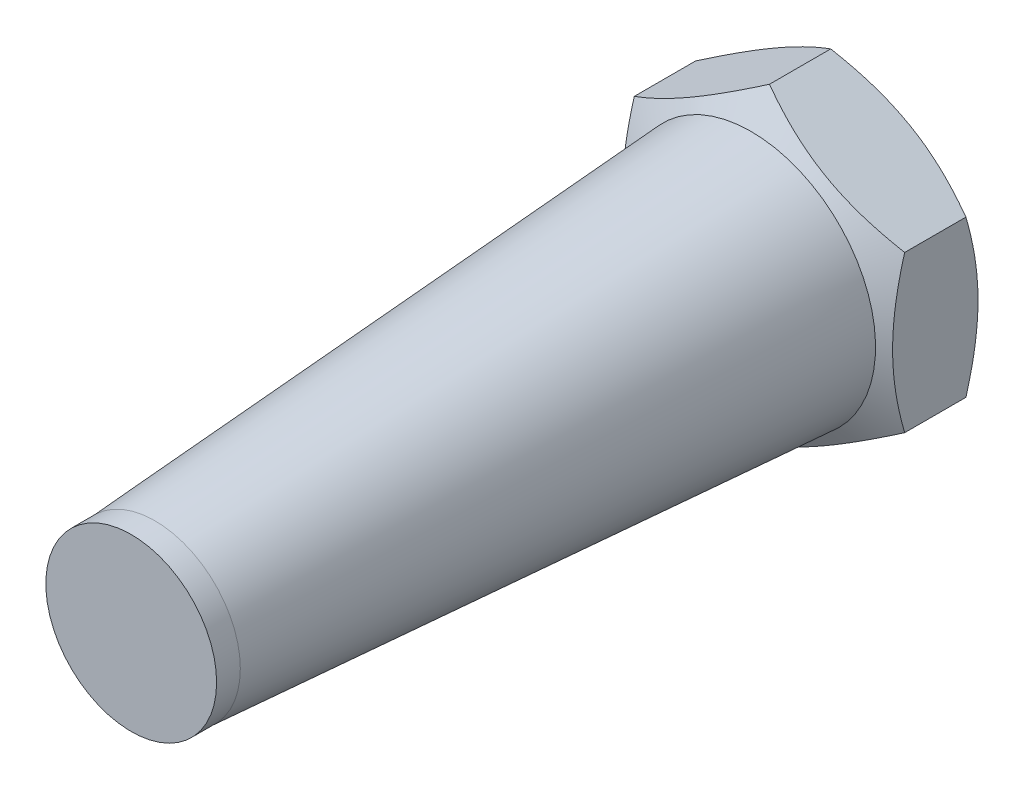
ISO-10303-21;
HEADER;
FILE_DESCRIPTION(('STEP AP214'),'2;1');
FILE_NAME('part.step','',(''),(''),'','','');
FILE_SCHEMA(('AUTOMOTIVE_DESIGN { 1 0 10303 214 1 1 1 1 }'));
ENDSEC;
DATA;
#1=APPLICATION_CONTEXT('core data for automotive mechanical design processes');
#2=APPLICATION_PROTOCOL_DEFINITION('international standard','automotive_design',2000,#1);
#3=PRODUCT_CONTEXT('',#1,'mechanical');
#4=PRODUCT('Part','Part','',(#3));
#5=PRODUCT_RELATED_PRODUCT_CATEGORY('part','',(#4));
#6=PRODUCT_DEFINITION_FORMATION('','',#4);
#7=PRODUCT_DEFINITION_CONTEXT('part definition',#1,'design');
#8=PRODUCT_DEFINITION('design','',#6,#7);
#9=PRODUCT_DEFINITION_SHAPE('','',#8);
#10=(LENGTH_UNIT() NAMED_UNIT(*) SI_UNIT(.MILLI.,.METRE.));
#11=(NAMED_UNIT(*) PLANE_ANGLE_UNIT() SI_UNIT($,.RADIAN.));
#12=(NAMED_UNIT(*) SI_UNIT($,.STERADIAN.) SOLID_ANGLE_UNIT());
#13=UNCERTAINTY_MEASURE_WITH_UNIT(LENGTH_MEASURE(1.E-05),#10,'distance_accuracy_value','');
#14=(GEOMETRIC_REPRESENTATION_CONTEXT(3) GLOBAL_UNCERTAINTY_ASSIGNED_CONTEXT((#13)) GLOBAL_UNIT_ASSIGNED_CONTEXT((#10,
#11,#12)) REPRESENTATION_CONTEXT('',''));
#15=CARTESIAN_POINT('',(0.,0.,0.));
#16=DIRECTION('',(0.,0.,1.));
#17=DIRECTION('',(1.,0.,0.));
#18=AXIS2_PLACEMENT_3D('',#15,#16,#17);
#19=CARTESIAN_POINT('',(0.,0.,3.));
#20=DIRECTION('',(0.,0.,-1.));
#21=DIRECTION('',(-0.500000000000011,0.866025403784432,0.));
#22=AXIS2_PLACEMENT_3D('',#19,#20,#21);
#23=CONICAL_SURFACE('',#22,14.696152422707,1.04719755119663);
#24=CARTESIAN_POINT('',(0.,0.,6.4387862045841));
#25=DIRECTION('',(0.,0.,-1.));
#26=DIRECTION('',(-0.500000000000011,0.866025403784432,0.));
#27=AXIS2_PLACEMENT_3D('',#24,#25,#26);
#28=CIRCLE('',#27,8.74);
#29=CARTESIAN_POINT('',(-4.3700000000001,7.56906202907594,6.4387862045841));
#30=VERTEX_POINT('',#29);
#31=EDGE_CURVE('E280',#30,#30,#28,.T.);
#32=ORIENTED_EDGE('',*,*,#31,.T.);
#33=EDGE_LOOP('',(#32));
#34=FACE_BOUND('',#33,.T.);
#35=CARTESIAN_POINT('',(-17.554595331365,0.83450477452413,1.33823181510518));
#36=CARTESIAN_POINT('',(-17.3747338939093,0.938347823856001,1.43910889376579));
#37=CARTESIAN_POINT('',(-17.1946626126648,1.04231202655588,1.53948688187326));
#38=CARTESIAN_POINT('',(-16.8340565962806,1.25050800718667,1.73913173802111));
#39=CARTESIAN_POINT('',(-16.653521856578,1.35473978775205,1.83839859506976));
#40=CARTESIAN_POINT('',(-16.1111093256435,1.66790180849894,2.13438889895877));
#41=CARTESIAN_POINT('',(-15.7484757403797,1.87726840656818,2.32927254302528));
#42=CARTESIAN_POINT('',(-15.0188452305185,2.29852077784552,2.71400300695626));
#43=CARTESIAN_POINT('',(-14.651835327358,2.5104140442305,2.90381708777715));
#44=CARTESIAN_POINT('',(-13.9149128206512,2.9358764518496,3.27574988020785));
#45=CARTESIAN_POINT('',(-13.5450003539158,3.14944551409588,3.45786895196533));
#46=CARTESIAN_POINT('',(-12.7895973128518,3.58557766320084,3.81814124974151));
#47=CARTESIAN_POINT('',(-12.4039911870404,3.80820746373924,3.99597319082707));
#48=CARTESIAN_POINT('',(-11.6282855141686,4.25606134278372,4.33830520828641));
#49=CARTESIAN_POINT('',(-11.238185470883,4.48128570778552,4.50280379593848));
#50=CARTESIAN_POINT('',(-10.4535819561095,4.93427675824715,4.81418869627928));
#51=CARTESIAN_POINT('',(-10.0590890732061,5.1620373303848,4.96111020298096));
#52=CARTESIAN_POINT('',(-9.26445874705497,5.62081736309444,5.23266326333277));
#53=CARTESIAN_POINT('',(-8.86432310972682,5.85183578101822,5.35730178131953));
#54=CARTESIAN_POINT('',(-8.06032905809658,6.31602196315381,5.57767285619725));
#55=CARTESIAN_POINT('',(-7.65650395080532,6.54917049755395,5.67356307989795));
#56=CARTESIAN_POINT('',(-7.04705287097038,6.90103724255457,5.79170894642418));
#57=CARTESIAN_POINT('',(-6.84326907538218,7.01869187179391,5.82681089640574));
#58=CARTESIAN_POINT('',(-6.43467315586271,7.25459483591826,5.88776442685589));
#59=CARTESIAN_POINT('',(-6.22986113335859,7.37284311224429,5.91361690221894));
#60=CARTESIAN_POINT('',(-5.82217958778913,7.60821816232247,5.9552293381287));
#61=CARTESIAN_POINT('',(-5.61931991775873,7.72533924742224,5.97111749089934));
#62=CARTESIAN_POINT('',(-5.2132003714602,7.95981247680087,5.99297114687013));
#63=CARTESIAN_POINT('',(-5.00994050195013,8.07716461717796,5.99893681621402));
#64=CARTESIAN_POINT('',(-4.60338385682,8.31189020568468,6.00080302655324));
#65=CARTESIAN_POINT('',(-4.40008708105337,8.42926365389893,5.9967035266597));
#66=CARTESIAN_POINT('',(-3.99382512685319,8.66381910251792,5.97854027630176));
#67=CARTESIAN_POINT('',(-3.79085996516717,8.78100109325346,5.96447603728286));
#68=CARTESIAN_POINT('',(-3.3044770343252,9.06181440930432,5.91913176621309));
#69=CARTESIAN_POINT('',(-3.02137657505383,9.22526253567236,5.88321395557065));
#70=CARTESIAN_POINT('',(-2.45726005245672,9.55095536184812,5.79393895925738));
#71=CARTESIAN_POINT('',(-2.17624427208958,9.71319989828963,5.74057944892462));
#72=CARTESIAN_POINT('',(-1.3366568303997,10.1979359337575,5.55716611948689));
#73=CARTESIAN_POINT('',(-0.781851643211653,10.5182528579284,5.40380988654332));
#74=CARTESIAN_POINT('',(0.0478465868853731,10.997279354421,5.13760699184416));
#75=CARTESIAN_POINT('',(0.327036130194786,11.1584695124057,5.04158640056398));
#76=CARTESIAN_POINT('',(0.882703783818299,11.4792843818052,4.8395066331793));
#77=CARTESIAN_POINT('',(1.15918187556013,11.6389090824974,4.7334473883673));
#78=CARTESIAN_POINT('',(1.70951316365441,11.9566429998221,4.51299759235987));
#79=CARTESIAN_POINT('',(1.98336717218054,12.1147526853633,4.39860971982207));
#80=CARTESIAN_POINT('',(2.52880163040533,12.4296594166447,4.16285521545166));
#81=CARTESIAN_POINT('',(2.80038211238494,12.5864564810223,4.04148868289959));
#82=CARTESIAN_POINT('',(3.46345047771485,12.9692791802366,3.73693329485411));
#83=CARTESIAN_POINT('',(3.85382887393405,13.1946642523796,3.5505288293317));
#84=CARTESIAN_POINT('',(4.63109013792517,13.6434162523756,3.16821435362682));
#85=CARTESIAN_POINT('',(5.01797275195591,13.866783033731,2.9723036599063));
#86=CARTESIAN_POINT('',(5.78893210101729,14.3118966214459,2.57297026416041));
#87=CARTESIAN_POINT('',(6.17300807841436,14.5336429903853,2.36954561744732));
#88=CARTESIAN_POINT('',(6.93874708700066,14.9757426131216,1.95677322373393));
#89=CARTESIAN_POINT('',(7.32041017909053,15.1960959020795,1.74742562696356));
#90=CARTESIAN_POINT('',(8.08220788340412,15.635920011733,1.32370484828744));
#91=CARTESIAN_POINT('',(8.46234006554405,15.8553894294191,1.1093258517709));
#92=CARTESIAN_POINT('',(9.22094119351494,16.2933679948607,0.676679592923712));
#93=CARTESIAN_POINT('',(9.5994101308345,16.511877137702,0.458412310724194));
#94=CARTESIAN_POINT('',(10.354894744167,16.9480563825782,0.0187149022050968));
#95=CARTESIAN_POINT('',(10.7319106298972,17.1657266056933,-0.202714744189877));
#96=CARTESIAN_POINT('',(11.4847633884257,17.6003863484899,-0.648231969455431));
#97=CARTESIAN_POINT('',(11.8606002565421,17.8173758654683,-0.872319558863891));
#98=CARTESIAN_POINT('',(12.9195383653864,18.4287540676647,-1.50766534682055));
#99=CARTESIAN_POINT('',(13.6014831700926,18.8224750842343,-1.92149328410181));
#100=CARTESIAN_POINT('',(14.9628991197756,19.6084889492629,-2.7546043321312));
#101=CARTESIAN_POINT('',(15.6423701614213,20.0007817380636,-3.17388766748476));
#102=CARTESIAN_POINT('',(16.997542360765,20.783190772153,-4.01545975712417));
#103=CARTESIAN_POINT('',(17.6732487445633,21.1733100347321,-4.43773729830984));
#104=CARTESIAN_POINT('',(18.6856528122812,21.7578217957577,-5.07354826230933));
#105=CARTESIAN_POINT('',(19.0229182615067,21.9525420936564,-5.28587802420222));
#106=CARTESIAN_POINT('',(19.6971091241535,22.3417863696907,-5.7112548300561));
#107=CARTESIAN_POINT('',(20.0340345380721,22.5363103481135,-5.92430187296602));
#108=CARTESIAN_POINT('',(20.3708096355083,22.7307475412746,-6.13766535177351));
#109=B_SPLINE_CURVE_WITH_KNOTS('',3,(#35,#36,#37,#38,#39,#40,#41,#42,#43,#44,#45,#46,#47,#48,
#49,#50,#51,#52,#53,#54,#55,#56,#57,#58,#59,#60,#61,#62,#63,#64,#65,#66,#67,#68,#69,#70,#71,#72,
#73,#74,#75,#76,#77,#78,#79,#80,#81,#82,#83,#84,#85,#86,#87,#88,#89,#90,#91,#92,#93,#94,#95,#96,
#97,#98,#99,#100,#101,#102,#103,#104,#105,#106,#107,#108),.UNSPECIFIED.,.F.,.F.,(4,2,2,2,2,2,2,
2,2,2,2,2,2,2,2,2,2,2,2,2,2,2,2,2,2,2,2,2,2,2,2,2,2,2,2,2,4),(0.,0.692665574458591,
1.38533799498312,2.77088518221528,4.16388664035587,5.55682282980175,6.99503223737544,
8.4334020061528,9.86884178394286,11.3038321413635,12.7308020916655,13.4443879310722,
14.1579047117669,14.8620428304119,15.5661691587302,16.2702983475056,16.9744620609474,
17.9604967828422,18.9466629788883,20.9200570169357,21.9291006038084,22.9381510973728,
23.946878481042,24.9555915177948,26.4188141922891,27.8821422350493,29.3458516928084,
30.8095240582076,32.2749804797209,33.7404443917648,35.205688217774,36.6709378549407,
39.3395877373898,42.0083478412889,44.6698810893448,46.0005687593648,47.3312544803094),.UNSPECIFIED.);
#110=CARTESIAN_POINT('',(-1.81278603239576E-13,10.9696551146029,5.15149422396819));
#111=VERTEX_POINT('',#110);
#112=CARTESIAN_POINT('',(-9.5,5.48482755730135,5.15149422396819));
#113=VERTEX_POINT('',#112);
#114=EDGE_CURVE('E102',#111,#113,#109,.F.);
#115=ORIENTED_EDGE('',*,*,#114,.T.);
#116=CARTESIAN_POINT('',(-9.5,5.48505849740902,5.15142755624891));
#117=CARTESIAN_POINT('',(-9.5,5.24392149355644,5.22102656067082));
#118=CARTESIAN_POINT('',(-9.5,5.00188540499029,5.28746669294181));
#119=CARTESIAN_POINT('',(-9.5,4.51587227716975,5.41315271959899));
#120=CARTESIAN_POINT('',(-9.5,4.27189462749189,5.4723962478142));
#121=CARTESIAN_POINT('',(-9.5,3.53603045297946,5.63818542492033));
#122=CARTESIAN_POINT('',(-9.5,3.04123900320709,5.73248555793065));
#123=CARTESIAN_POINT('',(-9.5,2.30080624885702,5.84306129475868));
#124=CARTESIAN_POINT('',(-9.5,2.05737704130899,5.87456017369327));
#125=CARTESIAN_POINT('',(-9.5,1.56939156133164,5.92738179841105));
#126=CARTESIAN_POINT('',(-9.5,1.32483526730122,5.94870434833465));
#127=CARTESIAN_POINT('',(-9.5,0.83531474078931,5.98062697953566));
#128=CARTESIAN_POINT('',(-9.5,0.590351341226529,5.99123980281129));
#129=CARTESIAN_POINT('',(-9.5,0.100198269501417,6.00151746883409));
#130=CARTESIAN_POINT('',(-9.5,-0.14499139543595,6.00118264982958));
#131=CARTESIAN_POINT('',(-9.5,-0.603379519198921,5.99032663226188));
#132=CARTESIAN_POINT('',(-9.5,-0.816610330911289,5.98112973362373));
#133=CARTESIAN_POINT('',(-9.5,-1.24257325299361,5.95463460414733));
#134=CARTESIAN_POINT('',(-9.5,-1.45530532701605,5.9373358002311));
#135=CARTESIAN_POINT('',(-9.5,-2.09267726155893,5.87369551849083));
#136=CARTESIAN_POINT('',(-9.5,-2.51618892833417,5.81561809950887));
#137=CARTESIAN_POINT('',(-9.5,-3.36770470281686,5.67042398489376));
#138=CARTESIAN_POINT('',(-9.5,-3.79560013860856,5.58269183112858));
#139=CARTESIAN_POINT('',(-9.5,-4.64501006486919,5.38357626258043));
#140=CARTESIAN_POINT('',(-9.5,-5.06653543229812,5.27223961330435));
#141=CARTESIAN_POINT('',(-9.5,-5.4850584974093,5.15142755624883));
#142=B_SPLINE_CURVE_WITH_KNOTS('',3,(#116,#117,#118,#119,#120,#121,#122,#123,#124,#125,#126,
#127,#128,#129,#130,#131,#132,#133,#134,#135,#136,#137,#138,#139,#140,#141),.UNSPECIFIED.,.F.,
.F.,(4,2,2,2,2,2,2,2,2,2,2,2,4),(0.,0.752880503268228,1.50600787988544,3.01546870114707,
3.75167336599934,4.48789219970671,5.22323407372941,5.9585532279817,6.59868084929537,
7.23885375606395,8.52010929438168,9.82978009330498,11.1368800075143),.UNSPECIFIED.);
#143=CARTESIAN_POINT('',(-9.5,-5.48482755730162,5.15149422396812));
#144=VERTEX_POINT('',#143);
#145=EDGE_CURVE('E93',#113,#144,#142,.T.);
#146=ORIENTED_EDGE('',*,*,#145,.T.);
#147=CARTESIAN_POINT('',(-9.5002,-5.48471208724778,5.15142755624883));
#148=CARTESIAN_POINT('',(-9.2913692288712,-5.60528058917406,5.22102656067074));
#149=CARTESIAN_POINT('',(-9.08175982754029,-5.72629863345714,5.28746669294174));
#150=CARTESIAN_POINT('',(-8.66086011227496,-5.9693051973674,5.41315271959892));
#151=CARTESIAN_POINT('',(-8.4495692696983,-6.09129402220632,5.47239624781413));
#152=CARTESIAN_POINT('',(-7.81229220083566,-6.45922610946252,5.63818542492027));
#153=CARTESIAN_POINT('',(-7.38379023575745,-6.7066218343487,5.7324855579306));
#154=CARTESIAN_POINT('',(-6.74255666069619,-7.07683821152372,5.84306129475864));
#155=CARTESIAN_POINT('',(-6.53174078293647,-7.19855281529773,5.87456017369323));
#156=CARTESIAN_POINT('',(-6.10913296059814,-7.4425455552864,5.92738179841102));
#157=CARTESIAN_POINT('',(-5.89734099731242,-7.5648237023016,5.94870434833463));
#158=CARTESIAN_POINT('',(-5.47340378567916,-7.80958396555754,5.98062697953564));
#159=CARTESIAN_POINT('',(-5.26125925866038,-7.93206566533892,5.99123980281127));
#160=CARTESIAN_POINT('',(-4.83677424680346,-8.17714220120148,6.00151746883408));
#161=CARTESIAN_POINT('',(-4.62443376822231,-8.29973703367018,6.00118264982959));
#162=CARTESIAN_POINT('',(-4.22745800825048,-8.52893109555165,5.99032663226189));
#163=CARTESIAN_POINT('',(-4.04279470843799,-8.63554650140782,5.98112973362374));
#164=CARTESIAN_POINT('',(-3.67389999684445,-8.84852796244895,5.95463460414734));
#165=CARTESIAN_POINT('',(-3.48966861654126,-8.95489399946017,5.93733580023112));
#166=CARTESIAN_POINT('',(-2.93768832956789,-9.2735799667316,5.87369551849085));
#167=CARTESIAN_POINT('',(-2.57091646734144,-9.4853358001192,5.81561809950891));
#168=CARTESIAN_POINT('',(-1.83348217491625,-9.91109368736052,5.67042398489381));
#169=CARTESIAN_POINT('',(-1.46291385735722,-10.1250414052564,5.58269183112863));
#170=CARTESIAN_POINT('',(-0.72730328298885,-10.5497463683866,5.38357626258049));
#171=CARTESIAN_POINT('',(-0.362251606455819,-10.7605090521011,5.27223961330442));
#172=CARTESIAN_POINT('',(0.000200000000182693,-10.9697705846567,5.15142755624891));
#173=B_SPLINE_CURVE_WITH_KNOTS('',3,(#147,#148,#149,#150,#151,#152,#153,#154,#155,#156,#157,
#158,#159,#160,#161,#162,#163,#164,#165,#166,#167,#168,#169,#170,#171,#172),.UNSPECIFIED.,.F.,
.F.,(4,2,2,2,2,2,2,2,2,2,2,2,4),(0.,0.752880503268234,1.50600787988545,3.01546870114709,
3.75167336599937,4.48789219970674,5.22323407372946,5.95855322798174,6.59868084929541,
7.23885375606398,8.5201092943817,9.82978009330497,11.1368800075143),.UNSPECIFIED.);
#174=CARTESIAN_POINT('',(1.81278603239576E-13,-10.9696551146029,5.15149422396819));
#175=VERTEX_POINT('',#174);
#176=EDGE_CURVE('E82',#144,#175,#173,.T.);
#177=ORIENTED_EDGE('',*,*,#176,.T.);
#178=CARTESIAN_POINT('',(-8.0545953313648,-15.6199778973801,1.33823181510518));
#179=CARTESIAN_POINT('',(-7.87473389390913,-15.5161348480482,1.43910889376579));
#180=CARTESIAN_POINT('',(-7.69466261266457,-15.4121706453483,1.53948688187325));
#181=CARTESIAN_POINT('',(-7.33405659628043,-15.2039746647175,1.7391317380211));
#182=CARTESIAN_POINT('',(-7.15352185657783,-15.0997428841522,1.83839859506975));
#183=CARTESIAN_POINT('',(-6.61110932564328,-14.7865808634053,2.13438889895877));
#184=CARTESIAN_POINT('',(-6.24847574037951,-14.577214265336,2.32927254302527));
#185=CARTESIAN_POINT('',(-5.51884523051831,-14.1559618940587,2.71400300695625));
#186=CARTESIAN_POINT('',(-5.15183532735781,-13.9440686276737,2.90381708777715));
#187=CARTESIAN_POINT('',(-4.41491282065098,-13.5186062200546,3.27574988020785));
#188=CARTESIAN_POINT('',(-4.04500035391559,-13.3050371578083,3.45786895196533));
#189=CARTESIAN_POINT('',(-3.28959731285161,-12.8689050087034,3.81814124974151));
#190=CARTESIAN_POINT('',(-2.90399118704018,-12.646275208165,3.99597319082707));
#191=CARTESIAN_POINT('',(-2.12828551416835,-12.1984213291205,4.33830520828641));
#192=CARTESIAN_POINT('',(-1.73818547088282,-11.9731969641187,4.50280379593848));
#193=CARTESIAN_POINT('',(-0.953581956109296,-11.5202059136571,4.81418869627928));
#194=CARTESIAN_POINT('',(-0.559089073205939,-11.2924453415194,4.96111020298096));
#195=CARTESIAN_POINT('',(0.235541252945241,-10.8336653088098,5.23266326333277));
#196=CARTESIAN_POINT('',(0.635676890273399,-10.602646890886,5.35730178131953));
#197=CARTESIAN_POINT('',(1.43967094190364,-10.1384607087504,5.57767285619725));
#198=CARTESIAN_POINT('',(1.84349604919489,-9.90531217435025,5.67356307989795));
#199=CARTESIAN_POINT('',(2.45294712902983,-9.55344542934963,5.79170894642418));
#200=CARTESIAN_POINT('',(2.65673092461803,-9.4357908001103,5.82681089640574));
#201=CARTESIAN_POINT('',(3.06532684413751,-9.19988783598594,5.8877644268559));
#202=CARTESIAN_POINT('',(3.27013886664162,-9.08163955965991,5.91361690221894));
#203=CARTESIAN_POINT('',(3.67782041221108,-8.84626450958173,5.9552293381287));
#204=CARTESIAN_POINT('',(3.88068008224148,-8.72914342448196,5.97111749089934));
#205=CARTESIAN_POINT('',(4.28679962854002,-8.49467019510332,5.99297114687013));
#206=CARTESIAN_POINT('',(4.49005949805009,-8.37731805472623,5.99893681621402));
#207=CARTESIAN_POINT('',(4.89661614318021,-8.14259246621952,6.00080302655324));
#208=CARTESIAN_POINT('',(5.09991291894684,-8.02521901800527,5.9967035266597));
#209=CARTESIAN_POINT('',(5.50617487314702,-7.79066356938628,5.97854027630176));
#210=CARTESIAN_POINT('',(5.70914003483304,-7.67348157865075,5.96447603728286));
#211=CARTESIAN_POINT('',(6.19552296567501,-7.39266826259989,5.91913176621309));
#212=CARTESIAN_POINT('',(6.47862342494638,-7.22922013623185,5.88321395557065));
#213=CARTESIAN_POINT('',(7.04273994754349,-6.90352731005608,5.79393895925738));
#214=CARTESIAN_POINT('',(7.32375572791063,-6.74128277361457,5.74057944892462));
#215=CARTESIAN_POINT('',(8.16334316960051,-6.25654673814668,5.55716611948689));
#216=CARTESIAN_POINT('',(8.71814835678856,-5.93622981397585,5.40380988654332));
#217=CARTESIAN_POINT('',(9.54784658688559,-5.45720331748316,5.13760699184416));
#218=CARTESIAN_POINT('',(9.827036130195,-5.29601315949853,5.04158640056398));
#219=CARTESIAN_POINT('',(10.3827037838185,-4.97519829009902,4.8395066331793));
#220=CARTESIAN_POINT('',(10.6591818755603,-4.81557358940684,4.7334473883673));
#221=CARTESIAN_POINT('',(11.2095131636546,-4.49783967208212,4.51299759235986));
#222=CARTESIAN_POINT('',(11.4833671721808,-4.3397299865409,4.39860971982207));
#223=CARTESIAN_POINT('',(12.0288016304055,-4.02482325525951,4.16285521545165));
#224=CARTESIAN_POINT('',(12.3003821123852,-3.86802619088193,4.04148868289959));
#225=CARTESIAN_POINT('',(12.9634504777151,-3.48520349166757,3.73693329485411));
#226=CARTESIAN_POINT('',(13.3538288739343,-3.25981841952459,3.5505288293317));
#227=CARTESIAN_POINT('',(14.1310901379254,-2.81106641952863,3.16821435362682));
#228=CARTESIAN_POINT('',(14.5179727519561,-2.58769963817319,2.97230365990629));
#229=CARTESIAN_POINT('',(15.2889321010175,-2.14258605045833,2.57297026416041));
#230=CARTESIAN_POINT('',(15.6730080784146,-1.92083968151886,2.36954561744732));
#231=CARTESIAN_POINT('',(16.4387470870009,-1.47874005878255,1.95677322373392));
#232=CARTESIAN_POINT('',(16.8204101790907,-1.25838676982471,1.74742562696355));
#233=CARTESIAN_POINT('',(17.5822078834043,-0.818562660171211,1.32370484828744));
#234=CARTESIAN_POINT('',(17.9623400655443,-0.599093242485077,1.1093258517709));
#235=CARTESIAN_POINT('',(18.7209411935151,-0.16111467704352,0.676679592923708));
#236=CARTESIAN_POINT('',(19.0994101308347,0.0573944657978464,0.45841231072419));
#237=CARTESIAN_POINT('',(19.8548947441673,0.493573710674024,0.0187149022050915));
#238=CARTESIAN_POINT('',(20.2319106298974,0.711243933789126,-0.202714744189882));
#239=CARTESIAN_POINT('',(20.9847633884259,1.14590367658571,-0.648231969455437));
#240=CARTESIAN_POINT('',(21.3606002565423,1.36289319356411,-0.872319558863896));
#241=CARTESIAN_POINT('',(22.4195383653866,1.97427139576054,-1.50766534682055));
#242=CARTESIAN_POINT('',(23.1014831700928,2.3679924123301,-1.92149328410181));
#243=CARTESIAN_POINT('',(24.4628991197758,3.15400627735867,-2.7546043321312));
#244=CARTESIAN_POINT('',(25.1423701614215,3.54629906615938,-3.17388766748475));
#245=CARTESIAN_POINT('',(26.4975423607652,4.3287081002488,-4.01545975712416));
#246=CARTESIAN_POINT('',(27.1732487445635,4.7188273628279,-4.43773729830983));
#247=CARTESIAN_POINT('',(28.1856528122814,5.3033391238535,-5.07354826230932));
#248=CARTESIAN_POINT('',(28.5229182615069,5.49805942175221,-5.28587802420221));
#249=CARTESIAN_POINT('',(29.1971091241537,5.88730369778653,-5.71125483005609));
#250=CARTESIAN_POINT('',(29.5340345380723,6.08182767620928,-5.92430187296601));
#251=CARTESIAN_POINT('',(29.8708096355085,6.27626486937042,-6.13766535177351));
#252=B_SPLINE_CURVE_WITH_KNOTS('',3,(#178,#179,#180,#181,#182,#183,#184,#185,#186,#187,#188,
#189,#190,#191,#192,#193,#194,#195,#196,#197,#198,#199,#200,#201,#202,#203,#204,#205,#206,#207,
#208,#209,#210,#211,#212,#213,#214,#215,#216,#217,#218,#219,#220,#221,#222,#223,#224,#225,#226,
#227,#228,#229,#230,#231,#232,#233,#234,#235,#236,#237,#238,#239,#240,#241,#242,#243,#244,#245,
#246,#247,#248,#249,#250,#251),.UNSPECIFIED.,.F.,.F.,(4,2,2,2,2,2,2,2,2,2,2,2,2,2,2,2,2,2,2,2,2,
2,2,2,2,2,2,2,2,2,2,2,2,2,2,2,4),(0.,0.692665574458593,1.38533799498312,2.77088518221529,
4.16388664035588,5.55682282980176,6.99503223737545,8.43340200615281,9.86884178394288,
11.3038321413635,12.7308020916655,13.4443879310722,14.1579047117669,14.8620428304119,
15.5661691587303,16.2702983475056,16.9744620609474,17.9604967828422,18.9466629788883,
20.9200570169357,21.9291006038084,22.9381510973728,23.946878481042,24.9555915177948,
26.4188141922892,27.8821422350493,29.3458516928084,30.8095240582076,32.2749804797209,
33.7404443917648,35.205688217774,36.6709378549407,39.3395877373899,42.0083478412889,
44.6698810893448,46.0005687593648,47.3312544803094),.UNSPECIFIED.);
#253=CARTESIAN_POINT('',(9.5,-5.48482755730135,5.15149422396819));
#254=VERTEX_POINT('',#253);
#255=EDGE_CURVE('E229',#175,#254,#252,.T.);
#256=ORIENTED_EDGE('',*,*,#255,.T.);
#257=CARTESIAN_POINT('',(9.5,-5.48505849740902,5.15142755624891));
#258=CARTESIAN_POINT('',(9.5,-5.24392149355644,5.22102656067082));
#259=CARTESIAN_POINT('',(9.5,-5.00188540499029,5.28746669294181));
#260=CARTESIAN_POINT('',(9.5,-4.51587227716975,5.41315271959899));
#261=CARTESIAN_POINT('',(9.5,-4.27189462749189,5.4723962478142));
#262=CARTESIAN_POINT('',(9.5,-3.53603045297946,5.63818542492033));
#263=CARTESIAN_POINT('',(9.5,-3.04123900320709,5.73248555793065));
#264=CARTESIAN_POINT('',(9.5,-2.30080624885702,5.84306129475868));
#265=CARTESIAN_POINT('',(9.5,-2.05737704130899,5.87456017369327));
#266=CARTESIAN_POINT('',(9.5,-1.56939156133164,5.92738179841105));
#267=CARTESIAN_POINT('',(9.5,-1.32483526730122,5.94870434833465));
#268=CARTESIAN_POINT('',(9.5,-0.83531474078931,5.98062697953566));
#269=CARTESIAN_POINT('',(9.5,-0.590351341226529,5.99123980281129));
#270=CARTESIAN_POINT('',(9.5,-0.100198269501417,6.00151746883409));
#271=CARTESIAN_POINT('',(9.5,0.14499139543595,6.00118264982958));
#272=CARTESIAN_POINT('',(9.5,0.603379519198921,5.99032663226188));
#273=CARTESIAN_POINT('',(9.5,0.816610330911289,5.98112973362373));
#274=CARTESIAN_POINT('',(9.5,1.24257325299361,5.95463460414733));
#275=CARTESIAN_POINT('',(9.5,1.45530532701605,5.9373358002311));
#276=CARTESIAN_POINT('',(9.5,2.09267726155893,5.87369551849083));
#277=CARTESIAN_POINT('',(9.5,2.51618892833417,5.81561809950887));
#278=CARTESIAN_POINT('',(9.5,3.36770470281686,5.67042398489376));
#279=CARTESIAN_POINT('',(9.5,3.79560013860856,5.58269183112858));
#280=CARTESIAN_POINT('',(9.5,4.64501006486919,5.38357626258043));
#281=CARTESIAN_POINT('',(9.5,5.06653543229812,5.27223961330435));
#282=CARTESIAN_POINT('',(9.5,5.4850584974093,5.15142755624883));
#283=B_SPLINE_CURVE_WITH_KNOTS('',3,(#257,#258,#259,#260,#261,#262,#263,#264,#265,#266,#267,
#268,#269,#270,#271,#272,#273,#274,#275,#276,#277,#278,#279,#280,#281,#282),.UNSPECIFIED.,.F.,
.F.,(4,2,2,2,2,2,2,2,2,2,2,2,4),(0.,0.752880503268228,1.50600787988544,3.01546870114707,
3.75167336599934,4.48789219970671,5.22323407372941,5.9585532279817,6.59868084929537,
7.23885375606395,8.52010929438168,9.82978009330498,11.1368800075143),.UNSPECIFIED.);
#284=CARTESIAN_POINT('',(9.5,5.48482755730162,5.15149422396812));
#285=VERTEX_POINT('',#284);
#286=EDGE_CURVE('E215',#254,#285,#283,.T.);
#287=ORIENTED_EDGE('',*,*,#286,.T.);
#288=CARTESIAN_POINT('',(9.5002,5.48471208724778,5.15142755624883));
#289=CARTESIAN_POINT('',(9.2913692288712,5.60528058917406,5.22102656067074));
#290=CARTESIAN_POINT('',(9.08175982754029,5.72629863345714,5.28746669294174));
#291=CARTESIAN_POINT('',(8.66086011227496,5.9693051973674,5.41315271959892));
#292=CARTESIAN_POINT('',(8.4495692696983,6.09129402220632,5.47239624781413));
#293=CARTESIAN_POINT('',(7.81229220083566,6.45922610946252,5.63818542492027));
#294=CARTESIAN_POINT('',(7.38379023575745,6.7066218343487,5.7324855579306));
#295=CARTESIAN_POINT('',(6.74255666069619,7.07683821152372,5.84306129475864));
#296=CARTESIAN_POINT('',(6.53174078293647,7.19855281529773,5.87456017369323));
#297=CARTESIAN_POINT('',(6.10913296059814,7.4425455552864,5.92738179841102));
#298=CARTESIAN_POINT('',(5.89734099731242,7.5648237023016,5.94870434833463));
#299=CARTESIAN_POINT('',(5.47340378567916,7.80958396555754,5.98062697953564));
#300=CARTESIAN_POINT('',(5.26125925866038,7.93206566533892,5.99123980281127));
#301=CARTESIAN_POINT('',(4.83677424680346,8.17714220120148,6.00151746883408));
#302=CARTESIAN_POINT('',(4.62443376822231,8.29973703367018,6.00118264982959));
#303=CARTESIAN_POINT('',(4.22745800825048,8.52893109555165,5.99032663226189));
#304=CARTESIAN_POINT('',(4.04279470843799,8.63554650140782,5.98112973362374));
#305=CARTESIAN_POINT('',(3.67389999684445,8.84852796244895,5.95463460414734));
#306=CARTESIAN_POINT('',(3.48966861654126,8.95489399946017,5.93733580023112));
#307=CARTESIAN_POINT('',(2.93768832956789,9.2735799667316,5.87369551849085));
#308=CARTESIAN_POINT('',(2.57091646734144,9.4853358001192,5.81561809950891));
#309=CARTESIAN_POINT('',(1.83348217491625,9.91109368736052,5.67042398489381));
#310=CARTESIAN_POINT('',(1.46291385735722,10.1250414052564,5.58269183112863));
#311=CARTESIAN_POINT('',(0.72730328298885,10.5497463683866,5.38357626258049));
#312=CARTESIAN_POINT('',(0.362251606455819,10.7605090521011,5.27223961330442));
#313=CARTESIAN_POINT('',(-0.000200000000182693,10.9697705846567,5.15142755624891));
#314=B_SPLINE_CURVE_WITH_KNOTS('',3,(#288,#289,#290,#291,#292,#293,#294,#295,#296,#297,#298,
#299,#300,#301,#302,#303,#304,#305,#306,#307,#308,#309,#310,#311,#312,#313),.UNSPECIFIED.,.F.,
.F.,(4,2,2,2,2,2,2,2,2,2,2,2,4),(0.,0.752880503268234,1.50600787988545,3.01546870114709,
3.75167336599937,4.48789219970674,5.22323407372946,5.95855322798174,6.59868084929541,
7.23885375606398,8.5201092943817,9.82978009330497,11.1368800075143),.UNSPECIFIED.);
#315=EDGE_CURVE('E188',#285,#111,#314,.T.);
#316=ORIENTED_EDGE('',*,*,#315,.T.);
#317=EDGE_LOOP('',(#115,#146,#177,#256,#287,#316));
#318=FACE_BOUND('',#317,.T.);
#319=ADVANCED_FACE('F14',(#34,#318),#23,.T.);
#320=CARTESIAN_POINT('',(0.,0.,50.));
#321=DIRECTION('',(0.,0.,1.));
#322=DIRECTION('',(0.500000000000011,-0.866025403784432,0.));
#323=AXIS2_PLACEMENT_3D('',#320,#321,#322);
#324=PLANE('',#323);
#325=CARTESIAN_POINT('',(0.,0.,50.));
#326=DIRECTION('',(0.,0.,-1.));
#327=DIRECTION('',(-0.500000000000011,0.866025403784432,0.));
#328=AXIS2_PLACEMENT_3D('',#325,#326,#327);
#329=CIRCLE('',#328,6.);
#330=CARTESIAN_POINT('',(-3.00000000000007,5.19615242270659,50.));
#331=VERTEX_POINT('',#330);
#332=EDGE_CURVE('E9',#331,#331,#329,.T.);
#333=ORIENTED_EDGE('',*,*,#332,.F.);
#334=EDGE_LOOP('',(#333));
#335=FACE_BOUND('',#334,.T.);
#336=ADVANCED_FACE('F16',(#335),#324,.T.);
#337=CARTESIAN_POINT('',(0.,0.,26.653));
#338=DIRECTION('',(0.,0.,-1.));
#339=DIRECTION('',(-0.500000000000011,0.866025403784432,0.));
#340=AXIS2_PLACEMENT_3D('',#337,#338,#339);
#341=CYLINDRICAL_SURFACE('',#340,6.);
#342=ORIENTED_EDGE('',*,*,#332,.T.);
#343=EDGE_LOOP('',(#342));
#344=FACE_BOUND('',#343,.T.);
#345=CARTESIAN_POINT('',(0.,0.,48.333333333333));
#346=DIRECTION('',(0.,0.,-1.));
#347=DIRECTION('',(-0.500000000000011,0.866025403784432,0.));
#348=AXIS2_PLACEMENT_3D('',#345,#346,#347);
#349=CIRCLE('',#348,6.);
#350=CARTESIAN_POINT('',(-3.00000000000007,5.19615242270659,48.333333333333));
#351=VERTEX_POINT('',#350);
#352=EDGE_CURVE('E22',#351,#351,#349,.T.);
#353=ORIENTED_EDGE('',*,*,#352,.F.);
#354=EDGE_LOOP('',(#353));
#355=FACE_BOUND('',#354,.T.);
#356=ADVANCED_FACE('F301',(#344,#355),#341,.T.);
#357=CARTESIAN_POINT('',(0.,0.,6.4387862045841));
#358=DIRECTION('',(0.,0.,-1.));
#359=DIRECTION('',(-0.500000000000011,0.866025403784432,0.));
#360=AXIS2_PLACEMENT_3D('',#357,#358,#359);
#361=CONICAL_SURFACE('',#360,8.74,0.0653092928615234);
#362=ORIENTED_EDGE('',*,*,#352,.T.);
#363=EDGE_LOOP('',(#362));
#364=FACE_BOUND('',#363,.T.);
#365=ORIENTED_EDGE('',*,*,#31,.F.);
#366=EDGE_LOOP('',(#365));
#367=FACE_BOUND('',#366,.T.);
#368=ADVANCED_FACE('F131',(#364,#367),#361,.T.);
#369=CARTESIAN_POINT('',(-9.5,5.48482755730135,-50.));
#370=DIRECTION('',(-1.,0.,0.));
#371=DIRECTION('',(0.,-1.,0.));
#372=AXIS2_PLACEMENT_3D('',#369,#370,#371);
#373=PLANE('',#372);
#374=DIRECTION('',(0.,0.,1.));
#375=VECTOR('',#374,1.);
#376=CARTESIAN_POINT('',(-9.5,5.48482755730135,-50.));
#377=LINE('',#376,#375);
#378=CARTESIAN_POINT('',(-9.5,5.48482755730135,0.848505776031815));
#379=VERTEX_POINT('',#378);
#380=EDGE_CURVE('E258',#379,#113,#377,.T.);
#381=ORIENTED_EDGE('',*,*,#380,.F.);
#382=CARTESIAN_POINT('',(-9.5,-5.4850584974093,0.848572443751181));
#383=CARTESIAN_POINT('',(-9.5,-5.24392149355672,0.778973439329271));
#384=CARTESIAN_POINT('',(-9.5,-5.00188540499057,0.712533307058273));
#385=CARTESIAN_POINT('',(-9.5,-4.51587227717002,0.586847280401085));
#386=CARTESIAN_POINT('',(-9.5,-4.27189462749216,0.527603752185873));
#387=CARTESIAN_POINT('',(-9.5,-3.53603045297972,0.361814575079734));
#388=CARTESIAN_POINT('',(-9.5,-3.04123900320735,0.267514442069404));
#389=CARTESIAN_POINT('',(-9.5,-2.30080624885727,0.156938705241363));
#390=CARTESIAN_POINT('',(-9.5,-2.05737704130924,0.125439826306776));
#391=CARTESIAN_POINT('',(-9.5,-1.56939156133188,0.0726182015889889));
#392=CARTESIAN_POINT('',(-9.5,-1.32483526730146,0.0512956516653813));
#393=CARTESIAN_POINT('',(-9.5,-0.835314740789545,0.0193730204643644));
#394=CARTESIAN_POINT('',(-9.5,-0.590351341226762,0.00876019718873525));
#395=CARTESIAN_POINT('',(-9.5,-0.100198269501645,-0.00151746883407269));
#396=CARTESIAN_POINT('',(-9.5,0.144991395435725,-0.0011826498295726));
#397=CARTESIAN_POINT('',(-9.5,0.603379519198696,0.0096733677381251));
#398=CARTESIAN_POINT('',(-9.5,0.816610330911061,0.018870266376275));
#399=CARTESIAN_POINT('',(-9.5,1.24257325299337,0.0453653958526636));
#400=CARTESIAN_POINT('',(-9.5,1.45530532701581,0.0626641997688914));
#401=CARTESIAN_POINT('',(-9.5,2.09267726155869,0.126304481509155));
#402=CARTESIAN_POINT('',(-9.5,2.51618892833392,0.184381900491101));
#403=CARTESIAN_POINT('',(-9.5,3.3677047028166,0.3295760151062));
#404=CARTESIAN_POINT('',(-9.5,3.7956001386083,0.417308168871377));
#405=CARTESIAN_POINT('',(-9.5,4.64501006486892,0.616423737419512));
#406=CARTESIAN_POINT('',(-9.5,5.06653543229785,0.727760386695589));
#407=CARTESIAN_POINT('',(-9.5,5.48505849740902,0.848572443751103));
#408=B_SPLINE_CURVE_WITH_KNOTS('',3,(#382,#383,#384,#385,#386,#387,#388,#389,#390,#391,#392,
#393,#394,#395,#396,#397,#398,#399,#400,#401,#402,#403,#404,#405,#406,#407),.UNSPECIFIED.,.F.,
.F.,(4,2,2,2,2,2,2,2,2,2,2,2,4),(0.,0.752880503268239,1.50600787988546,3.0154687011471,
3.75167336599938,4.48789219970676,5.22323407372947,5.95855322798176,6.59868084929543,
7.238853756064,8.52010929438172,9.829780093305,11.1368800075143),.UNSPECIFIED.);
#409=CARTESIAN_POINT('',(-9.5,0.,0.));
#410=VERTEX_POINT('',#409);
#411=EDGE_CURVE('E109',#410,#379,#408,.T.);
#412=ORIENTED_EDGE('',*,*,#411,.F.);
#413=CARTESIAN_POINT('',(-9.5,-5.48482755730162,0.848505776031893));
#414=VERTEX_POINT('',#413);
#415=EDGE_CURVE('E96',#414,#410,#408,.T.);
#416=ORIENTED_EDGE('',*,*,#415,.F.);
#417=DIRECTION('',(0.,0.,1.));
#418=VECTOR('',#417,1.);
#419=CARTESIAN_POINT('',(-9.5,-5.48482755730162,-50.));
#420=LINE('',#419,#418);
#421=EDGE_CURVE('E35',#414,#144,#420,.T.);
#422=ORIENTED_EDGE('',*,*,#421,.T.);
#423=ORIENTED_EDGE('',*,*,#145,.F.);
#424=EDGE_LOOP('',(#381,#412,#416,#422,#423));
#425=FACE_BOUND('',#424,.T.);
#426=ADVANCED_FACE('F92',(#425),#373,.T.);
#427=CARTESIAN_POINT('',(-1.81278603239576E-13,10.9696551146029,-50.));
#428=DIRECTION('',(-0.500000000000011,0.866025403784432,0.));
#429=DIRECTION('',(-0.866025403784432,-0.500000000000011,0.));
#430=AXIS2_PLACEMENT_3D('',#427,#428,#429);
#431=PLANE('',#430);
#432=DIRECTION('',(0.,0.,1.));
#433=VECTOR('',#432,1.);
#434=CARTESIAN_POINT('',(-1.81278603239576E-13,10.9696551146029,-50.));
#435=LINE('',#434,#433);
#436=CARTESIAN_POINT('',(-1.81278603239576E-13,10.9696551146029,0.848505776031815));
#437=VERTEX_POINT('',#436);
#438=EDGE_CURVE('E255',#437,#111,#435,.T.);
#439=ORIENTED_EDGE('',*,*,#438,.F.);
#440=CARTESIAN_POINT('',(-17.6079762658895,0.803685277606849,4.69172618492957));
#441=CARTESIAN_POINT('',(-17.4278975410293,0.907653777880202,4.59060472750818));
#442=CARTESIAN_POINT('',(-17.2476101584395,1.01174274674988,4.48997893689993));
#443=CARTESIAN_POINT('',(-16.8865745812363,1.22018673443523,4.28983072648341));
#444=CARTESIAN_POINT('',(-16.7058263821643,1.32454175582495,4.19030831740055));
#445=CARTESIAN_POINT('',(-16.1627785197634,1.63807058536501,3.89353871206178));
#446=CARTESIAN_POINT('',(-15.799727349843,1.84767827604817,3.69811828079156));
#447=CARTESIAN_POINT('',(-15.0692994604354,2.26939101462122,3.3122810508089));
#448=CARTESIAN_POINT('',(-14.7019100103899,2.48150341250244,3.12189630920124));
#449=CARTESIAN_POINT('',(-13.9642441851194,2.90739497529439,2.74876351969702));
#450=CARTESIAN_POINT('',(-13.5939679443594,3.12117406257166,2.56601511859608));
#451=CARTESIAN_POINT('',(-12.8375931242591,3.55786726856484,2.20426740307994));
#452=CARTESIAN_POINT('',(-12.4513771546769,3.78084916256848,2.02559358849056));
#453=CARTESIAN_POINT('',(-11.674464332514,4.22939998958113,1.68149388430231));
#454=CARTESIAN_POINT('',(-11.2837669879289,4.45496920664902,1.5160694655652));
#455=CARTESIAN_POINT('',(-10.4979649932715,4.90865219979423,1.20272862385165));
#456=CARTESIAN_POINT('',(-10.1028707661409,5.13675995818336,1.05477771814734));
#457=CARTESIAN_POINT('',(-9.30702925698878,5.59623926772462,0.781054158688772));
#458=CARTESIAN_POINT('',(-8.90628376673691,5.82760978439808,0.655274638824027));
#459=CARTESIAN_POINT('',(-8.10110070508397,6.29248244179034,0.43254028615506));
#460=CARTESIAN_POINT('',(-7.69669749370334,6.52596474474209,0.335424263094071));
#461=CARTESIAN_POINT('',(-7.08633198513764,6.87835943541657,0.215390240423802));
#462=CARTESIAN_POINT('',(-6.88223572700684,6.99619446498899,0.179650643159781));
#463=CARTESIAN_POINT('',(-6.4729954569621,7.23246944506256,0.11741628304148));
#464=CARTESIAN_POINT('',(-6.26785154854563,7.35090933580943,0.0909206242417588));
#465=CARTESIAN_POINT('',(-5.85951371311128,7.58666329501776,0.048040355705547));
#466=CARTESIAN_POINT('',(-5.65633002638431,7.70397145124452,0.0315262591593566));
#467=CARTESIAN_POINT('',(-5.24953960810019,7.93883200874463,0.00844006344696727));
#468=CARTESIAN_POINT('',(-5.04593288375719,8.05638440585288,0.00186779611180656));
#469=CARTESIAN_POINT('',(-4.6386613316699,8.29152274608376,-0.00117752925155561));
#470=CARTESIAN_POINT('',(-4.43499650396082,8.40910868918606,0.00234940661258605));
#471=CARTESIAN_POINT('',(-4.02797922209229,8.64410022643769,0.0194147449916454));
#472=CARTESIAN_POINT('',(-3.82462678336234,8.76150581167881,0.0329536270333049));
#473=CARTESIAN_POINT('',(-3.33886786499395,9.04195885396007,0.0769634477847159));
#474=CARTESIAN_POINT('',(-3.05676444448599,9.20483133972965,0.111994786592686));
#475=CARTESIAN_POINT('',(-2.49460019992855,9.52939701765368,0.199439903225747));
#476=CARTESIAN_POINT('',(-2.21453964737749,9.69109005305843,0.25185594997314));
#477=CARTESIAN_POINT('',(-1.37777018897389,10.1741991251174,0.432406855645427));
#478=CARTESIAN_POINT('',(-0.824774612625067,10.4934712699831,0.583813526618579));
#479=CARTESIAN_POINT('',(0.00221202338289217,10.9709322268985,0.84712031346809));
#480=CARTESIAN_POINT('',(0.280475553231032,11.131587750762,0.942164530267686));
#481=CARTESIAN_POINT('',(0.834301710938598,11.4513394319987,1.1423154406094));
#482=CARTESIAN_POINT('',(1.10986432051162,11.6104355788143,1.24742220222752));
#483=CARTESIAN_POINT('',(1.65837183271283,11.9271165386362,1.46599605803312));
#484=CARTESIAN_POINT('',(1.93131752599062,12.0847018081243,1.57946053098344));
#485=CARTESIAN_POINT('',(2.47493670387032,12.3985604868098,1.81339584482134));
#486=CARTESIAN_POINT('',(2.74561021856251,12.5548339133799,1.93386659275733));
#487=CARTESIAN_POINT('',(3.39739076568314,12.9311395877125,2.23211274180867));
#488=CARTESIAN_POINT('',(3.7774841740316,13.1505866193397,2.41283667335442));
#489=CARTESIAN_POINT('',(4.53431346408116,13.5875422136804,2.78345507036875));
#490=CARTESIAN_POINT('',(4.91104911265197,13.8050506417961,2.97335016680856));
#491=CARTESIAN_POINT('',(5.66180844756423,14.2385017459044,3.36042547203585));
#492=CARTESIAN_POINT('',(6.03583142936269,14.4544440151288,3.557607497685));
#493=CARTESIAN_POINT('',(6.78153668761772,14.8849771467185,3.95774536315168));
#494=CARTESIAN_POINT('',(7.15321902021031,15.0995680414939,4.16070106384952));
#495=CARTESIAN_POINT('',(7.89508306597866,15.5278834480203,4.5715234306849));
#496=CARTESIAN_POINT('',(8.26526246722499,15.7416066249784,4.77939565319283));
#497=CARTESIAN_POINT('',(9.0039939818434,16.1681134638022,5.19895991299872));
#498=CARTESIAN_POINT('',(9.37254608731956,16.3808971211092,5.41065196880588));
#499=CARTESIAN_POINT('',(10.1082260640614,16.8056421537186,5.83715506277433));
#500=CARTESIAN_POINT('',(10.4753541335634,17.0176036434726,6.05196564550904));
#501=CARTESIAN_POINT('',(11.208449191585,17.440856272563,6.48421388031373));
#502=CARTESIAN_POINT('',(11.5744161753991,17.6521474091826,6.70165154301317));
#503=CARTESIAN_POINT('',(12.6069850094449,18.2483013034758,7.31908016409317));
#504=CARTESIAN_POINT('',(13.2724375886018,18.632500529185,7.72163366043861));
#505=CARTESIAN_POINT('',(14.6008779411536,19.3994759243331,8.53218731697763));
#506=CARTESIAN_POINT('',(15.2638656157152,19.7822520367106,8.94018769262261));
#507=CARTESIAN_POINT('',(16.5861399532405,20.5456674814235,9.75924293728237));
#508=CARTESIAN_POINT('',(17.245431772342,20.9263097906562,10.1702867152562));
#509=CARTESIAN_POINT('',(18.2332133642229,21.4966057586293,10.7892558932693));
#510=CARTESIAN_POINT('',(18.5622716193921,21.6865876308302,10.995973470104));
#511=CARTESIAN_POINT('',(19.2200473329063,22.0663546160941,11.4101289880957));
#512=CARTESIAN_POINT('',(19.5487647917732,22.2561397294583,11.6175669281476));
#513=CARTESIAN_POINT('',(19.8773314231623,22.4458377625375,11.825323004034));
#514=B_SPLINE_CURVE_WITH_KNOTS('',3,(#440,#441,#442,#443,#444,#445,#446,#447,#448,#449,#450,
#451,#452,#453,#454,#455,#456,#457,#458,#459,#460,#461,#462,#463,#464,#465,#466,#467,#468,#469,
#470,#471,#472,#473,#474,#475,#476,#477,#478,#479,#480,#481,#482,#483,#484,#485,#486,#487,#488,
#489,#490,#491,#492,#493,#494,#495,#496,#497,#498,#499,#500,#501,#502,#503,#504,#505,#506,#507,
#508,#509,#510,#511,#512,#513),.UNSPECIFIED.,.F.,.F.,(4,2,2,2,2,2,2,2,2,2,2,2,2,2,2,2,2,2,2,2,2,
2,2,2,2,2,2,2,2,2,2,2,2,2,2,2,4),(0.,0.693663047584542,1.3873328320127,2.77487186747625,
4.16977436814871,5.56461227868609,7.00572345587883,8.44699439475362,9.88537180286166,
11.3233029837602,12.7529867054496,13.4679278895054,14.1827997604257,14.8881868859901,
15.5935620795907,16.2989368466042,17.0043454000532,17.9866623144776,18.9691074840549,
20.9350403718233,21.940173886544,22.9453142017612,23.9501406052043,24.9549536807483,
26.3787498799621,27.8026441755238,29.2268959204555,30.6511133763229,32.0770255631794,
33.5029446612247,34.9286575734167,36.3543762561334,38.956720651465,41.5591682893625,
44.154653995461,45.4523211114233,46.7499862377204),.UNSPECIFIED.);
#515=CARTESIAN_POINT('',(-4.75000000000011,8.22724133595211,0.));
#516=VERTEX_POINT('',#515);
#517=EDGE_CURVE('E180',#516,#437,#514,.T.);
#518=ORIENTED_EDGE('',*,*,#517,.F.);
#519=EDGE_CURVE('E187',#379,#516,#514,.T.);
#520=ORIENTED_EDGE('',*,*,#519,.F.);
#521=ORIENTED_EDGE('',*,*,#380,.T.);
#522=ORIENTED_EDGE('',*,*,#114,.F.);
#523=EDGE_LOOP('',(#439,#518,#520,#521,#522));
#524=FACE_BOUND('',#523,.T.);
#525=ADVANCED_FACE('F130',(#524),#431,.T.);
#526=CARTESIAN_POINT('',(9.5,5.48482755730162,-50.));
#527=DIRECTION('',(0.499999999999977,0.866025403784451,0.));
#528=DIRECTION('',(-0.866025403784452,0.499999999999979,0.));
#529=AXIS2_PLACEMENT_3D('',#526,#527,#528);
#530=PLANE('',#529);
#531=DIRECTION('',(0.,0.,1.));
#532=VECTOR('',#531,1.);
#533=CARTESIAN_POINT('',(9.5,5.48482755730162,-50.));
#534=LINE('',#533,#532);
#535=CARTESIAN_POINT('',(9.5,5.48482755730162,0.848505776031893));
#536=VERTEX_POINT('',#535);
#537=EDGE_CURVE('E250',#536,#285,#534,.T.);
#538=ORIENTED_EDGE('',*,*,#537,.F.);
#539=CARTESIAN_POINT('',(-0.000200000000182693,10.9697705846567,0.848572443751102));
#540=CARTESIAN_POINT('',(0.208630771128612,10.8492020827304,0.778973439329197));
#541=CARTESIAN_POINT('',(0.418240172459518,10.7281840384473,0.712533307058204));
#542=CARTESIAN_POINT('',(0.839139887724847,10.4851774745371,0.586847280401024));
#543=CARTESIAN_POINT('',(1.0504307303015,10.3631886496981,0.527603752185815));
#544=CARTESIAN_POINT('',(1.68770779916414,9.99525656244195,0.361814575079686));
#545=CARTESIAN_POINT('',(2.11620976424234,9.74786083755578,0.267514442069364));
#546=CARTESIAN_POINT('',(2.7574433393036,9.37764446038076,0.156938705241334));
#547=CARTESIAN_POINT('',(2.96825921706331,9.25592985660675,0.125439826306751));
#548=CARTESIAN_POINT('',(3.39086703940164,9.01193711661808,0.0726182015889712));
#549=CARTESIAN_POINT('',(3.60265900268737,8.88965896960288,0.0512956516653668));
#550=CARTESIAN_POINT('',(4.02659621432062,8.64489870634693,0.0193730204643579));
#551=CARTESIAN_POINT('',(4.23874074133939,8.52241700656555,0.00876019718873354));
#552=CARTESIAN_POINT('',(4.66322575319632,8.27734047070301,-0.00151746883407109));
#553=CARTESIAN_POINT('',(4.87556623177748,8.15474563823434,-0.00118264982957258));
#554=CARTESIAN_POINT('',(5.27254199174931,7.92555157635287,0.00967336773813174));
#555=CARTESIAN_POINT('',(5.45720529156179,7.81893617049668,0.0188702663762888));
#556=CARTESIAN_POINT('',(5.82610000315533,7.60595470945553,0.0453653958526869));
#557=CARTESIAN_POINT('',(6.01033138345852,7.49958867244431,0.062664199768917));
#558=CARTESIAN_POINT('',(6.5623116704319,7.18090270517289,0.126304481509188));
#559=CARTESIAN_POINT('',(6.92908353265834,6.96914687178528,0.184381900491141));
#560=CARTESIAN_POINT('',(7.66651782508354,6.54338898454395,0.329576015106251));
#561=CARTESIAN_POINT('',(8.03708614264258,6.32944126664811,0.417308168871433));
#562=CARTESIAN_POINT('',(8.77269671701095,5.90473630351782,0.616423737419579));
#563=CARTESIAN_POINT('',(9.13774839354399,5.69397361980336,0.72776038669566));
#564=CARTESIAN_POINT('',(9.5002,5.48471208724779,0.848572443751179));
#565=B_SPLINE_CURVE_WITH_KNOTS('',3,(#539,#540,#541,#542,#543,#544,#545,#546,#547,#548,#549,
#550,#551,#552,#553,#554,#555,#556,#557,#558,#559,#560,#561,#562,#563,#564),.UNSPECIFIED.,.F.,
.F.,(4,2,2,2,2,2,2,2,2,2,2,2,4),(0.,0.752880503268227,1.50600787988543,3.01546870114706,
3.75167336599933,4.4878921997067,5.22323407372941,5.95855322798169,6.59868084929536,
7.23885375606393,8.52010929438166,9.82978009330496,11.1368800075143),.UNSPECIFIED.);
#566=CARTESIAN_POINT('',(4.7499999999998,8.22724133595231,0.));
#567=VERTEX_POINT('',#566);
#568=EDGE_CURVE('E172',#567,#536,#565,.T.);
#569=ORIENTED_EDGE('',*,*,#568,.F.);
#570=EDGE_CURVE('E223',#437,#567,#565,.T.);
#571=ORIENTED_EDGE('',*,*,#570,.F.);
#572=ORIENTED_EDGE('',*,*,#438,.T.);
#573=ORIENTED_EDGE('',*,*,#315,.F.);
#574=EDGE_LOOP('',(#538,#569,#571,#572,#573));
#575=FACE_BOUND('',#574,.T.);
#576=ADVANCED_FACE('F200',(#575),#530,.T.);
#577=CARTESIAN_POINT('',(9.5,-5.48482755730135,-50.));
#578=DIRECTION('',(1.,0.,0.));
#579=DIRECTION('',(0.,1.,0.));
#580=AXIS2_PLACEMENT_3D('',#577,#578,#579);
#581=PLANE('',#580);
#582=DIRECTION('',(0.,0.,1.));
#583=VECTOR('',#582,1.);
#584=CARTESIAN_POINT('',(9.5,-5.48482755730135,-50.));
#585=LINE('',#584,#583);
#586=CARTESIAN_POINT('',(9.5,-5.48482755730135,0.848505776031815));
#587=VERTEX_POINT('',#586);
#588=EDGE_CURVE('E248',#587,#254,#585,.T.);
#589=ORIENTED_EDGE('',*,*,#588,.F.);
#590=CARTESIAN_POINT('',(9.5,5.4850584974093,0.848572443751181));
#591=CARTESIAN_POINT('',(9.5,5.24392149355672,0.778973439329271));
#592=CARTESIAN_POINT('',(9.5,5.00188540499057,0.712533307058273));
#593=CARTESIAN_POINT('',(9.5,4.51587227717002,0.586847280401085));
#594=CARTESIAN_POINT('',(9.5,4.27189462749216,0.527603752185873));
#595=CARTESIAN_POINT('',(9.5,3.53603045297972,0.361814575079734));
#596=CARTESIAN_POINT('',(9.5,3.04123900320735,0.267514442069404));
#597=CARTESIAN_POINT('',(9.5,2.30080624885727,0.156938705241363));
#598=CARTESIAN_POINT('',(9.5,2.05737704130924,0.125439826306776));
#599=CARTESIAN_POINT('',(9.5,1.56939156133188,0.0726182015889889));
#600=CARTESIAN_POINT('',(9.5,1.32483526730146,0.0512956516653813));
#601=CARTESIAN_POINT('',(9.5,0.835314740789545,0.0193730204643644));
#602=CARTESIAN_POINT('',(9.5,0.590351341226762,0.00876019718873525));
#603=CARTESIAN_POINT('',(9.5,0.100198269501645,-0.00151746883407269));
#604=CARTESIAN_POINT('',(9.5,-0.144991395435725,-0.0011826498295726));
#605=CARTESIAN_POINT('',(9.5,-0.603379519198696,0.0096733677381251));
#606=CARTESIAN_POINT('',(9.5,-0.816610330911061,0.018870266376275));
#607=CARTESIAN_POINT('',(9.5,-1.24257325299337,0.0453653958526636));
#608=CARTESIAN_POINT('',(9.5,-1.45530532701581,0.0626641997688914));
#609=CARTESIAN_POINT('',(9.5,-2.09267726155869,0.126304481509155));
#610=CARTESIAN_POINT('',(9.5,-2.51618892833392,0.184381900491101));
#611=CARTESIAN_POINT('',(9.5,-3.3677047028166,0.3295760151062));
#612=CARTESIAN_POINT('',(9.5,-3.7956001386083,0.417308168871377));
#613=CARTESIAN_POINT('',(9.5,-4.64501006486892,0.616423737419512));
#614=CARTESIAN_POINT('',(9.5,-5.06653543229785,0.727760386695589));
#615=CARTESIAN_POINT('',(9.5,-5.48505849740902,0.848572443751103));
#616=B_SPLINE_CURVE_WITH_KNOTS('',3,(#590,#591,#592,#593,#594,#595,#596,#597,#598,#599,#600,
#601,#602,#603,#604,#605,#606,#607,#608,#609,#610,#611,#612,#613,#614,#615),.UNSPECIFIED.,.F.,
.F.,(4,2,2,2,2,2,2,2,2,2,2,2,4),(0.,0.752880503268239,1.50600787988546,3.0154687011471,
3.75167336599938,4.48789219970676,5.22323407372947,5.95855322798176,6.59868084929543,
7.238853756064,8.52010929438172,9.829780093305,11.1368800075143),.UNSPECIFIED.);
#617=CARTESIAN_POINT('',(9.5,0.,0.));
#618=VERTEX_POINT('',#617);
#619=EDGE_CURVE('E164',#618,#587,#616,.T.);
#620=ORIENTED_EDGE('',*,*,#619,.F.);
#621=EDGE_CURVE('E221',#536,#618,#616,.T.);
#622=ORIENTED_EDGE('',*,*,#621,.F.);
#623=ORIENTED_EDGE('',*,*,#537,.T.);
#624=ORIENTED_EDGE('',*,*,#286,.F.);
#625=EDGE_LOOP('',(#589,#620,#622,#623,#624));
#626=FACE_BOUND('',#625,.T.);
#627=ADVANCED_FACE('F206',(#626),#581,.T.);
#628=CARTESIAN_POINT('',(1.81278603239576E-13,-10.9696551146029,-50.));
#629=DIRECTION('',(0.500000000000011,-0.866025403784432,0.));
#630=DIRECTION('',(0.866025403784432,0.500000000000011,0.));
#631=AXIS2_PLACEMENT_3D('',#628,#629,#630);
#632=PLANE('',#631);
#633=DIRECTION('',(0.,0.,1.));
#634=VECTOR('',#633,1.);
#635=CARTESIAN_POINT('',(1.81278603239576E-13,-10.9696551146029,-50.));
#636=LINE('',#635,#634);
#637=CARTESIAN_POINT('',(1.81278603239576E-13,-10.9696551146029,0.848505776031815));
#638=VERTEX_POINT('',#637);
#639=EDGE_CURVE('E29',#638,#175,#636,.T.);
#640=ORIENTED_EDGE('',*,*,#639,.F.);
#641=CARTESIAN_POINT('',(-8.10797626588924,-15.6507973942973,4.69172618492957));
#642=CARTESIAN_POINT('',(-7.92789754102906,-15.546828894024,4.59060472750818));
#643=CARTESIAN_POINT('',(-7.74761015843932,-15.4427399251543,4.48997893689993));
#644=CARTESIAN_POINT('',(-7.38657458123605,-15.234295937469,4.28983072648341));
#645=CARTESIAN_POINT('',(-7.20582638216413,-15.1299409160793,4.19030831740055));
#646=CARTESIAN_POINT('',(-6.66277851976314,-14.8164120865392,3.89353871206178));
#647=CARTESIAN_POINT('',(-6.29972734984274,-14.606804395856,3.69811828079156));
#648=CARTESIAN_POINT('',(-5.56929946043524,-14.185091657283,3.3122810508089));
#649=CARTESIAN_POINT('',(-5.20191001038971,-13.9729792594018,3.12189630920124));
#650=CARTESIAN_POINT('',(-4.46424418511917,-13.5470876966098,2.74876351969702));
#651=CARTESIAN_POINT('',(-4.09396794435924,-13.3333086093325,2.56601511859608));
#652=CARTESIAN_POINT('',(-3.33759312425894,-12.8966154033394,2.20426740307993));
#653=CARTESIAN_POINT('',(-2.9513771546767,-12.6736335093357,2.02559358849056));
#654=CARTESIAN_POINT('',(-2.17446433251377,-12.2250826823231,1.68149388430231));
#655=CARTESIAN_POINT('',(-1.78376698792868,-11.9995134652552,1.5160694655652));
#656=CARTESIAN_POINT('',(-0.997964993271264,-11.54583047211,1.20272862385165));
#657=CARTESIAN_POINT('',(-0.602870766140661,-11.3177227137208,1.05477771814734));
#658=CARTESIAN_POINT('',(0.192970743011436,-10.8582434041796,0.781054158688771));
#659=CARTESIAN_POINT('',(0.593716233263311,-10.6268728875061,0.655274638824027));
#660=CARTESIAN_POINT('',(1.39889929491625,-10.1620002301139,0.432540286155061));
#661=CARTESIAN_POINT('',(1.80330250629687,-9.92851792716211,0.335424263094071));
#662=CARTESIAN_POINT('',(2.41366801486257,-9.57612323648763,0.215390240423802));
#663=CARTESIAN_POINT('',(2.61776427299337,-9.45828820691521,0.179650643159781));
#664=CARTESIAN_POINT('',(3.02700454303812,-9.22201322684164,0.11741628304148));
#665=CARTESIAN_POINT('',(3.23214845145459,-9.10357333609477,0.0909206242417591));
#666=CARTESIAN_POINT('',(3.64048628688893,-8.86781937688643,0.0480403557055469));
#667=CARTESIAN_POINT('',(3.8436699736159,-8.75051122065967,0.0315262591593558));
#668=CARTESIAN_POINT('',(4.25046039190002,-8.51565066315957,0.0084400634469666));
#669=CARTESIAN_POINT('',(4.45406711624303,-8.39809826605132,0.00186779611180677));
#670=CARTESIAN_POINT('',(4.86133866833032,-8.16295992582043,-0.00117752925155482));
#671=CARTESIAN_POINT('',(5.06500349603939,-8.04537398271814,0.00234940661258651));
#672=CARTESIAN_POINT('',(5.47202077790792,-7.81038244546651,0.0194147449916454));
#673=CARTESIAN_POINT('',(5.67537321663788,-7.6929768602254,0.0329536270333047));
#674=CARTESIAN_POINT('',(6.16113213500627,-7.41252381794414,0.0769634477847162));
#675=CARTESIAN_POINT('',(6.44323555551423,-7.24965133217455,0.111994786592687));
#676=CARTESIAN_POINT('',(7.00539980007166,-6.92508565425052,0.199439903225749));
#677=CARTESIAN_POINT('',(7.28546035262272,-6.76339261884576,0.251855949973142));
#678=CARTESIAN_POINT('',(8.12222981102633,-6.28028354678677,0.432406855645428));
#679=CARTESIAN_POINT('',(8.67522538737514,-5.9610114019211,0.583813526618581));
#680=CARTESIAN_POINT('',(9.5022120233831,-5.48355044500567,0.847120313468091));
#681=CARTESIAN_POINT('',(9.78047555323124,-5.32289492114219,0.942164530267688));
#682=CARTESIAN_POINT('',(10.3343017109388,-5.00314323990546,1.1423154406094));
#683=CARTESIAN_POINT('',(10.6098643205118,-4.84404709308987,1.24742220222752));
#684=CARTESIAN_POINT('',(11.158371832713,-4.52736613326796,1.46599605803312));
#685=CARTESIAN_POINT('',(11.4313175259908,-4.36978086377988,1.57946053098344));
#686=CARTESIAN_POINT('',(11.9749367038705,-4.05592218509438,1.81339584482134));
#687=CARTESIAN_POINT('',(12.2456102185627,-3.89964875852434,1.93386659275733));
#688=CARTESIAN_POINT('',(12.8973907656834,-3.52334308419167,2.23211274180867));
#689=CARTESIAN_POINT('',(13.2774841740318,-3.30389605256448,2.41283667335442));
#690=CARTESIAN_POINT('',(14.0343134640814,-2.86694045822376,2.78345507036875));
#691=CARTESIAN_POINT('',(14.4110491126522,-2.64943203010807,2.97335016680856));
#692=CARTESIAN_POINT('',(15.1618084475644,-2.21598092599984,3.36042547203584));
#693=CARTESIAN_POINT('',(15.5358314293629,-2.00003865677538,3.557607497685));
#694=CARTESIAN_POINT('',(16.2815366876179,-1.56950552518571,3.95774536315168));
#695=CARTESIAN_POINT('',(16.6532190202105,-1.35491463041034,4.16070106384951));
#696=CARTESIAN_POINT('',(17.3950830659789,-0.926599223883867,4.5715234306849));
#697=CARTESIAN_POINT('',(17.7652624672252,-0.712876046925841,4.77939565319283));
#698=CARTESIAN_POINT('',(18.5039939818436,-0.286369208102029,5.19895991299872));
#699=CARTESIAN_POINT('',(18.8725460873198,-0.0735855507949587,5.41065196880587));
#700=CARTESIAN_POINT('',(19.6082260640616,0.35115948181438,5.83715506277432));
#701=CARTESIAN_POINT('',(19.9753541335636,0.563120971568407,6.05196564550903));
#702=CARTESIAN_POINT('',(20.7084491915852,0.986373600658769,6.48421388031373));
#703=CARTESIAN_POINT('',(21.0744161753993,1.19766473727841,6.70165154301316));
#704=CARTESIAN_POINT('',(22.1069850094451,1.79381863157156,7.31908016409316));
#705=CARTESIAN_POINT('',(22.772437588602,2.17801785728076,7.7216336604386));
#706=CARTESIAN_POINT('',(24.1008779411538,2.94499325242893,8.53218731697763));
#707=CARTESIAN_POINT('',(24.7638656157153,3.32776936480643,8.9401876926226));
#708=CARTESIAN_POINT('',(26.0861399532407,4.09118480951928,9.75924293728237));
#709=CARTESIAN_POINT('',(26.7454317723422,4.47182711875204,10.1702867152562));
#710=CARTESIAN_POINT('',(27.7332133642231,5.04212308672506,10.7892558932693));
#711=CARTESIAN_POINT('',(28.0622716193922,5.23210495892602,10.995973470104));
#712=CARTESIAN_POINT('',(28.7200473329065,5.61187194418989,11.4101289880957));
#713=CARTESIAN_POINT('',(29.0487647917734,5.80165705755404,11.6175669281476));
#714=CARTESIAN_POINT('',(29.3773314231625,5.99135509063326,11.825323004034));
#715=B_SPLINE_CURVE_WITH_KNOTS('',3,(#641,#642,#643,#644,#645,#646,#647,#648,#649,#650,#651,
#652,#653,#654,#655,#656,#657,#658,#659,#660,#661,#662,#663,#664,#665,#666,#667,#668,#669,#670,
#671,#672,#673,#674,#675,#676,#677,#678,#679,#680,#681,#682,#683,#684,#685,#686,#687,#688,#689,
#690,#691,#692,#693,#694,#695,#696,#697,#698,#699,#700,#701,#702,#703,#704,#705,#706,#707,#708,
#709,#710,#711,#712,#713,#714),.UNSPECIFIED.,.F.,.F.,(4,2,2,2,2,2,2,2,2,2,2,2,2,2,2,2,2,2,2,2,2,
2,2,2,2,2,2,2,2,2,2,2,2,2,2,2,4),(0.,0.693663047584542,1.3873328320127,2.77487186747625,
4.16977436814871,5.56461227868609,7.00572345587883,8.44699439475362,9.88537180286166,
11.3233029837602,12.7529867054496,13.4679278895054,14.1827997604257,14.8881868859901,
15.5935620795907,16.2989368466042,17.0043454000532,17.9866623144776,18.9691074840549,
20.9350403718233,21.940173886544,22.9453142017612,23.9501406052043,24.9549536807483,
26.3787498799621,27.8026441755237,29.2268959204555,30.6511133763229,32.0770255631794,
33.5029446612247,34.9286575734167,36.3543762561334,38.956720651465,41.5591682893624,
44.154653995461,45.4523211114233,46.7499862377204),.UNSPECIFIED.);
#716=CARTESIAN_POINT('',(4.75000000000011,-8.22724133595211,0.));
#717=VERTEX_POINT('',#716);
#718=EDGE_CURVE('E87',#717,#638,#715,.F.);
#719=ORIENTED_EDGE('',*,*,#718,.F.);
#720=EDGE_CURVE('E232',#587,#717,#715,.F.);
#721=ORIENTED_EDGE('',*,*,#720,.F.);
#722=ORIENTED_EDGE('',*,*,#588,.T.);
#723=ORIENTED_EDGE('',*,*,#255,.F.);
#724=EDGE_LOOP('',(#640,#719,#721,#722,#723));
#725=FACE_BOUND('',#724,.T.);
#726=ADVANCED_FACE('F211',(#725),#632,.T.);
#727=CARTESIAN_POINT('',(-9.5,-5.48482755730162,-50.));
#728=DIRECTION('',(-0.499999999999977,-0.866025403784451,0.));
#729=DIRECTION('',(0.866025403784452,-0.499999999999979,0.));
#730=AXIS2_PLACEMENT_3D('',#727,#728,#729);
#731=PLANE('',#730);
#732=ORIENTED_EDGE('',*,*,#421,.F.);
#733=CARTESIAN_POINT('',(0.000200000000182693,-10.9697705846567,0.848572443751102));
#734=CARTESIAN_POINT('',(-0.208630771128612,-10.8492020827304,0.778973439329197));
#735=CARTESIAN_POINT('',(-0.418240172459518,-10.7281840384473,0.712533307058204));
#736=CARTESIAN_POINT('',(-0.839139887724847,-10.4851774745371,0.586847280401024));
#737=CARTESIAN_POINT('',(-1.0504307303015,-10.3631886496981,0.527603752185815));
#738=CARTESIAN_POINT('',(-1.68770779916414,-9.99525656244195,0.361814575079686));
#739=CARTESIAN_POINT('',(-2.11620976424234,-9.74786083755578,0.267514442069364));
#740=CARTESIAN_POINT('',(-2.7574433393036,-9.37764446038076,0.156938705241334));
#741=CARTESIAN_POINT('',(-2.96825921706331,-9.25592985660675,0.125439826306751));
#742=CARTESIAN_POINT('',(-3.39086703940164,-9.01193711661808,0.0726182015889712));
#743=CARTESIAN_POINT('',(-3.60265900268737,-8.88965896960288,0.0512956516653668));
#744=CARTESIAN_POINT('',(-4.02659621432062,-8.64489870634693,0.0193730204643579));
#745=CARTESIAN_POINT('',(-4.23874074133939,-8.52241700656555,0.00876019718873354));
#746=CARTESIAN_POINT('',(-4.66322575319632,-8.27734047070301,-0.00151746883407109));
#747=CARTESIAN_POINT('',(-4.87556623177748,-8.15474563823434,-0.00118264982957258));
#748=CARTESIAN_POINT('',(-5.27254199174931,-7.92555157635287,0.00967336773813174));
#749=CARTESIAN_POINT('',(-5.45720529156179,-7.81893617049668,0.0188702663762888));
#750=CARTESIAN_POINT('',(-5.82610000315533,-7.60595470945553,0.0453653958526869));
#751=CARTESIAN_POINT('',(-6.01033138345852,-7.49958867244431,0.062664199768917));
#752=CARTESIAN_POINT('',(-6.5623116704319,-7.18090270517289,0.126304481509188));
#753=CARTESIAN_POINT('',(-6.92908353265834,-6.96914687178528,0.184381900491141));
#754=CARTESIAN_POINT('',(-7.66651782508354,-6.54338898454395,0.329576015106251));
#755=CARTESIAN_POINT('',(-8.03708614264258,-6.32944126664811,0.417308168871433));
#756=CARTESIAN_POINT('',(-8.77269671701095,-5.90473630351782,0.616423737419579));
#757=CARTESIAN_POINT('',(-9.13774839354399,-5.69397361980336,0.72776038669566));
#758=CARTESIAN_POINT('',(-9.5002,-5.48471208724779,0.848572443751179));
#759=B_SPLINE_CURVE_WITH_KNOTS('',3,(#733,#734,#735,#736,#737,#738,#739,#740,#741,#742,#743,
#744,#745,#746,#747,#748,#749,#750,#751,#752,#753,#754,#755,#756,#757,#758),.UNSPECIFIED.,.F.,
.F.,(4,2,2,2,2,2,2,2,2,2,2,2,4),(0.,0.752880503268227,1.50600787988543,3.01546870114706,
3.75167336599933,4.4878921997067,5.22323407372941,5.95855322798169,6.59868084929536,
7.23885375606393,8.52010929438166,9.82978009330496,11.1368800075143),.UNSPECIFIED.);
#760=CARTESIAN_POINT('',(-4.74999999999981,-8.2272413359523,0.));
#761=VERTEX_POINT('',#760);
#762=EDGE_CURVE('E149',#761,#414,#759,.T.);
#763=ORIENTED_EDGE('',*,*,#762,.F.);
#764=EDGE_CURVE('E88',#638,#761,#759,.T.);
#765=ORIENTED_EDGE('',*,*,#764,.F.);
#766=ORIENTED_EDGE('',*,*,#639,.T.);
#767=ORIENTED_EDGE('',*,*,#176,.F.);
#768=EDGE_LOOP('',(#732,#763,#765,#766,#767));
#769=FACE_BOUND('',#768,.T.);
#770=ADVANCED_FACE('F83',(#769),#731,.T.);
#771=CARTESIAN_POINT('',(0.,0.,0.));
#772=DIRECTION('',(0.,0.,1.));
#773=DIRECTION('',(0.500000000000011,-0.866025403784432,0.));
#774=AXIS2_PLACEMENT_3D('',#771,#772,#773);
#775=CONICAL_SURFACE('',#774,9.5,1.04719755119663);
#776=CARTESIAN_POINT('',(0.,0.,0.));
#777=DIRECTION('',(0.,0.,-1.));
#778=DIRECTION('',(-0.500000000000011,0.866025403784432,0.));
#779=AXIS2_PLACEMENT_3D('',#776,#777,#778);
#780=CIRCLE('',#779,9.5);
#781=EDGE_CURVE('E103',#410,#516,#780,.T.);
#782=ORIENTED_EDGE('',*,*,#781,.F.);
#783=ORIENTED_EDGE('',*,*,#411,.T.);
#784=ORIENTED_EDGE('',*,*,#519,.T.);
#785=EDGE_LOOP('',(#782,#783,#784));
#786=FACE_BOUND('',#785,.T.);
#787=ADVANCED_FACE('F144',(#786),#775,.T.);
#788=EDGE_CURVE('E243',#717,#761,#780,.T.);
#789=ORIENTED_EDGE('',*,*,#788,.F.);
#790=ORIENTED_EDGE('',*,*,#718,.T.);
#791=ORIENTED_EDGE('',*,*,#764,.T.);
#792=EDGE_LOOP('',(#789,#790,#791));
#793=FACE_BOUND('',#792,.T.);
#794=ADVANCED_FACE('F145',(#793),#775,.T.);
#795=EDGE_CURVE('E282',#618,#717,#780,.T.);
#796=ORIENTED_EDGE('',*,*,#795,.F.);
#797=ORIENTED_EDGE('',*,*,#619,.T.);
#798=ORIENTED_EDGE('',*,*,#720,.T.);
#799=EDGE_LOOP('',(#796,#797,#798));
#800=FACE_BOUND('',#799,.T.);
#801=ADVANCED_FACE('F290',(#800),#775,.T.);
#802=EDGE_CURVE('E275',#567,#618,#780,.T.);
#803=ORIENTED_EDGE('',*,*,#802,.F.);
#804=ORIENTED_EDGE('',*,*,#568,.T.);
#805=ORIENTED_EDGE('',*,*,#621,.T.);
#806=EDGE_LOOP('',(#803,#804,#805));
#807=FACE_BOUND('',#806,.T.);
#808=ADVANCED_FACE('F287',(#807),#775,.T.);
#809=EDGE_CURVE('E108',#516,#567,#780,.T.);
#810=ORIENTED_EDGE('',*,*,#809,.F.);
#811=ORIENTED_EDGE('',*,*,#517,.T.);
#812=ORIENTED_EDGE('',*,*,#570,.T.);
#813=EDGE_LOOP('',(#810,#811,#812));
#814=FACE_BOUND('',#813,.T.);
#815=ADVANCED_FACE('F138',(#814),#775,.T.);
#816=CARTESIAN_POINT('',(8.22724133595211,4.75000000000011,0.));
#817=DIRECTION('',(0.,0.,-1.));
#818=DIRECTION('',(-0.500000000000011,0.866025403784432,0.));
#819=AXIS2_PLACEMENT_3D('',#816,#817,#818);
#820=PLANE('',#819);
#821=CARTESIAN_POINT('',(0.,0.,0.));
#822=DIRECTION('',(0.,0.,-1.));
#823=DIRECTION('',(-0.866025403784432,-0.500000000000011,0.));
#824=AXIS2_PLACEMENT_3D('',#821,#822,#823);
#825=CIRCLE('',#824,6.);
#826=CARTESIAN_POINT('',(-5.19615242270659,-3.00000000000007,0.));
#827=VERTEX_POINT('',#826);
#828=EDGE_CURVE('E260',#827,#827,#825,.T.);
#829=ORIENTED_EDGE('',*,*,#828,.F.);
#830=EDGE_LOOP('',(#829));
#831=FACE_BOUND('',#830,.T.);
#832=ORIENTED_EDGE('',*,*,#809,.T.);
#833=ORIENTED_EDGE('',*,*,#802,.T.);
#834=ORIENTED_EDGE('',*,*,#795,.T.);
#835=ORIENTED_EDGE('',*,*,#788,.T.);
#836=EDGE_CURVE('E106',#761,#410,#780,.T.);
#837=ORIENTED_EDGE('',*,*,#836,.T.);
#838=ORIENTED_EDGE('',*,*,#781,.T.);
#839=EDGE_LOOP('',(#832,#833,#834,#835,#837,#838));
#840=FACE_BOUND('',#839,.T.);
#841=ADVANCED_FACE('F134',(#831,#840),#820,.T.);
#842=ORIENTED_EDGE('',*,*,#762,.T.);
#843=ORIENTED_EDGE('',*,*,#415,.T.);
#844=ORIENTED_EDGE('',*,*,#836,.F.);
#845=EDGE_LOOP('',(#842,#843,#844));
#846=FACE_BOUND('',#845,.T.);
#847=ADVANCED_FACE('F137',(#846),#775,.T.);
#848=CARTESIAN_POINT('',(0.,0.,16.));
#849=DIRECTION('',(0.,0.,-1.));
#850=DIRECTION('',(-0.866025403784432,-0.500000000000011,0.));
#851=AXIS2_PLACEMENT_3D('',#848,#849,#850);
#852=CYLINDRICAL_SURFACE('',#851,6.);
#853=CARTESIAN_POINT('',(0.,0.,16.));
#854=DIRECTION('',(0.,0.,-1.));
#855=DIRECTION('',(-0.866025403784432,-0.500000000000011,0.));
#856=AXIS2_PLACEMENT_3D('',#853,#854,#855);
#857=CIRCLE('',#856,6.);
#858=CARTESIAN_POINT('',(-5.19615242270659,-3.00000000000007,16.));
#859=VERTEX_POINT('',#858);
#860=EDGE_CURVE('E98',#859,#859,#857,.T.);
#861=ORIENTED_EDGE('',*,*,#860,.F.);
#862=EDGE_LOOP('',(#861));
#863=FACE_BOUND('',#862,.T.);
#864=ORIENTED_EDGE('',*,*,#828,.T.);
#865=EDGE_LOOP('',(#864));
#866=FACE_BOUND('',#865,.T.);
#867=ADVANCED_FACE('F142',(#863,#866),#852,.F.);
#868=CARTESIAN_POINT('',(0.,0.,16.));
#869=DIRECTION('',(0.,0.,-1.));
#870=DIRECTION('',(-0.866025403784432,-0.500000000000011,0.));
#871=AXIS2_PLACEMENT_3D('',#868,#869,#870);
#872=PLANE('',#871);
#873=ORIENTED_EDGE('',*,*,#860,.T.);
#874=EDGE_LOOP('',(#873));
#875=FACE_BOUND('',#874,.T.);
#876=ADVANCED_FACE('F266',(#875),#872,.T.);
#877=CLOSED_SHELL('',(#319,#336,#356,#368,#426,#525,#576,#627,#726,#770,#787,#794,#801,#808,
#815,#841,#847,#867,#876));
#878=MANIFOLD_SOLID_BREP('B1',#877);
#879=ADVANCED_BREP_SHAPE_REPRESENTATION('',(#18,#878),#14);
#880=SHAPE_DEFINITION_REPRESENTATION(#9,#879);
ENDSEC;
END-ISO-10303-21;
